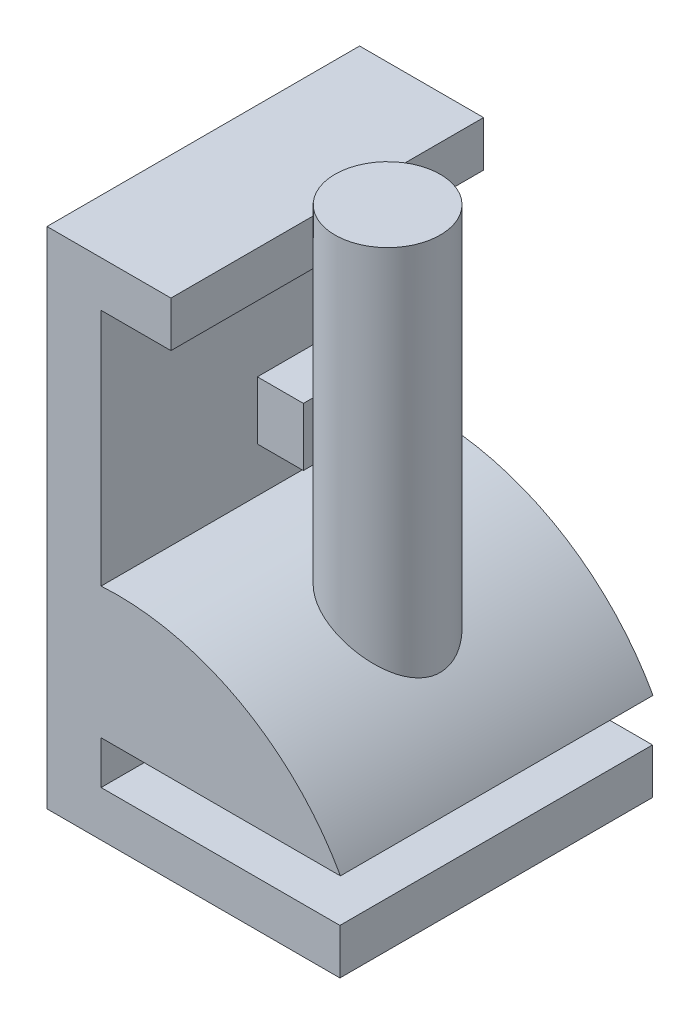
from build123d import *

# Parameters (mm, degrees)
EXTRUDE1_DEPTH           = 47.5
CUT_EXTRUDE1_REACH       = 189.204
SKETCH3_W                = 13.972525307
SKETCH3_H                = 47.5
BOSS_EXTRUDE1_REACH      = 230.18
BOSS_EXTRUDE1_END_RADIUS = 77.425998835
SKETCH2_R                = 15.997741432


with BuildPart() as part:
    # Sketch1 → Extrude1 (new, symmetric)
    with BuildSketch(Plane(origin=(8.56426308, -28.387824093, 0), x_dir=(0, 1, 0), z_dir=(0, 0, 1))):
        with BuildLine():
            Line((-58.163386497, -54.421285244), (95.115473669, -54.421285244))
            Line((95.115473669, -54.421285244), (95.115473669, -92.090296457))
            Line((95.115473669, -92.090296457), (81.274577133, -92.090296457))
            Line((81.274577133, -92.090296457), (81.274577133, -70.863158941))
            Line((81.274577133, -70.863158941), (40.017487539, -70.863158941))
            Line((40.017487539, -70.863158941), (40.017487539, -84.835684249))
            Line((40.017487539, -84.835684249), (22.334466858, -84.835684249))
            Line((22.334466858, -84.835684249), (22.334466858, -70.863158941))
            Line((22.334466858, -70.863158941), (8.693279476, -70.863158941))
            ThreePointArc((8.693279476, -70.863158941), (-0.701981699, -113.021085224), (-31.219824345, -143.586146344))
            Line((-31.219824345, -143.586146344), (-31.219824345, -70.863158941))
            Line((-31.219824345, -70.863158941), (-44.32248996, -70.863158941))
            Line((-44.32248996, -70.863158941), (-44.32248996, -143.440294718))
            Line((-44.32248996, -143.440294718), (-58.163386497, -143.440294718))
            Line((-58.163386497, -143.440294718), (-58.163386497, -54.421285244))
        make_face()
    extrude(amount=EXTRUDE1_DEPTH, both=True)

    # Sketch3 → Cut-Extrude1 (cut, up to next)
    with BuildSketch(Plane(origin=(0, 11.629663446, 0), x_dir=(-1, 0, 0), z_dir=(0, 1, 0)), mode=Mode.PRIVATE) as cut_extrude1_sk1:
        with Locations((-86.413684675, 23.75)):
            Rectangle(SKETCH3_W, SKETCH3_H)
    cut_extrude1_tool1 = extrude(cut_extrude1_sk1.sketch, amount=-CUT_EXTRUDE1_REACH, mode=Mode.PRIVATE) & part.part
    add(cut_extrude1_tool1.solids().sort_by_distance((86.413685, 11.629663, 23.75))[0], mode=Mode.SUBTRACT)

    # Boss-Extrude1: up to this cylinder (the profile starts outside it)
    boss_extrude1_end = Plane(origin=(84.332901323, -96.964988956, 0), z_dir=(0, 0, -1)) * Cylinder(BOSS_EXTRUDE1_END_RADIUS, 616.21199767, mode=Mode.PRIVATE)
    # Sketch2 → Boss-Extrude1 (add, up to the surface)
    with BuildSketch(Plane(origin=(0, 76.727649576, 0), x_dir=(-1, 0, 0), z_dir=(0, 1, 0)), mode=Mode.PRIVATE) as boss_extrude1_sk1:
        with Locations((-118.997137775, 0)):
            Circle(SKETCH2_R)
    boss_extrude1_tool1 = extrude(boss_extrude1_sk1.sketch, amount=-BOSS_EXTRUDE1_REACH, mode=Mode.PRIVATE) - boss_extrude1_end
    add(boss_extrude1_tool1.solids().sort_by_distance((118.997138, 76.72765, 0))[0])


solid = part.part
